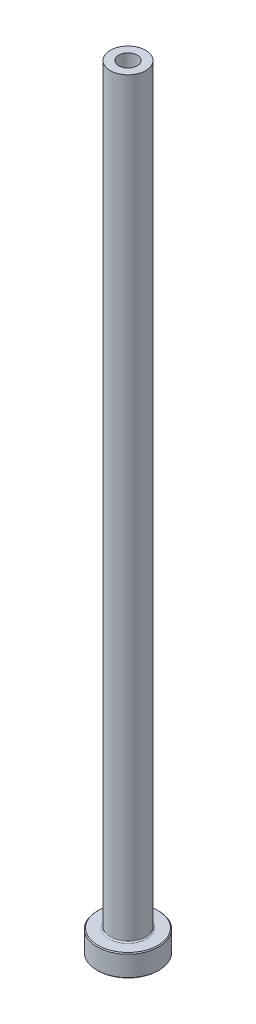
ISO-10303-21;
HEADER;
FILE_DESCRIPTION(('STEP AP214'),'2;1');
FILE_NAME('part.step','',(''),(''),'','','');
FILE_SCHEMA(('AUTOMOTIVE_DESIGN { 1 0 10303 214 1 1 1 1 }'));
ENDSEC;
DATA;
#1=APPLICATION_CONTEXT('core data for automotive mechanical design processes');
#2=APPLICATION_PROTOCOL_DEFINITION('international standard','automotive_design',2000,#1);
#3=PRODUCT_CONTEXT('',#1,'mechanical');
#4=PRODUCT('Part','Part','',(#3));
#5=PRODUCT_RELATED_PRODUCT_CATEGORY('part','',(#4));
#6=PRODUCT_DEFINITION_FORMATION('','',#4);
#7=PRODUCT_DEFINITION_CONTEXT('part definition',#1,'design');
#8=PRODUCT_DEFINITION('design','',#6,#7);
#9=PRODUCT_DEFINITION_SHAPE('','',#8);
#10=(LENGTH_UNIT() NAMED_UNIT(*) SI_UNIT(.MILLI.,.METRE.));
#11=(NAMED_UNIT(*) PLANE_ANGLE_UNIT() SI_UNIT($,.RADIAN.));
#12=(NAMED_UNIT(*) SI_UNIT($,.STERADIAN.) SOLID_ANGLE_UNIT());
#13=UNCERTAINTY_MEASURE_WITH_UNIT(LENGTH_MEASURE(1.E-05),#10,'distance_accuracy_value','');
#14=(GEOMETRIC_REPRESENTATION_CONTEXT(3) GLOBAL_UNCERTAINTY_ASSIGNED_CONTEXT((#13)) GLOBAL_UNIT_ASSIGNED_CONTEXT((#10,
#11,#12)) REPRESENTATION_CONTEXT('',''));
#15=CARTESIAN_POINT('',(0.,0.,0.));
#16=DIRECTION('',(0.,0.,1.));
#17=DIRECTION('',(1.,0.,0.));
#18=AXIS2_PLACEMENT_3D('',#15,#16,#17);
#19=CARTESIAN_POINT('',(0.,92.1876809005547,0.));
#20=DIRECTION('',(0.,1.,0.));
#21=DIRECTION('',(0.,0.,1.));
#22=AXIS2_PLACEMENT_3D('',#19,#20,#21);
#23=CYLINDRICAL_SURFACE('',#22,2.1);
#24=CARTESIAN_POINT('',(0.,175.,0.));
#25=DIRECTION('',(0.,1.,0.));
#26=DIRECTION('',(0.,0.,1.));
#27=AXIS2_PLACEMENT_3D('',#24,#25,#26);
#28=CIRCLE('',#27,2.1);
#29=CARTESIAN_POINT('',(0.,175.,2.1));
#30=VERTEX_POINT('',#29);
#31=EDGE_CURVE('E62',#30,#30,#28,.T.);
#32=ORIENTED_EDGE('',*,*,#31,.T.);
#33=EDGE_LOOP('',(#32));
#34=FACE_BOUND('',#33,.T.);
#35=CARTESIAN_POINT('',(0.,130.,0.));
#36=DIRECTION('',(0.,1.,0.));
#37=DIRECTION('',(0.,0.,1.));
#38=AXIS2_PLACEMENT_3D('',#35,#36,#37);
#39=CIRCLE('',#38,2.1);
#40=CARTESIAN_POINT('',(0.,130.,2.1));
#41=VERTEX_POINT('',#40);
#42=EDGE_CURVE('E71',#41,#41,#39,.T.);
#43=ORIENTED_EDGE('',*,*,#42,.F.);
#44=EDGE_LOOP('',(#43));
#45=FACE_BOUND('',#44,.T.);
#46=ADVANCED_FACE('F30',(#34,#45),#23,.F.);
#47=CARTESIAN_POINT('',(-2.1,175.,0.));
#48=DIRECTION('',(0.,1.,0.));
#49=DIRECTION('',(0.,0.,1.));
#50=AXIS2_PLACEMENT_3D('',#47,#48,#49);
#51=PLANE('',#50);
#52=CARTESIAN_POINT('',(0.,175.,0.));
#53=DIRECTION('',(0.,1.,0.));
#54=DIRECTION('',(0.,0.,1.));
#55=AXIS2_PLACEMENT_3D('',#52,#53,#54);
#56=CIRCLE('',#55,4.00000000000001);
#57=CARTESIAN_POINT('',(0.,175.,4.00000000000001));
#58=VERTEX_POINT('',#57);
#59=EDGE_CURVE('E65',#58,#58,#56,.T.);
#60=ORIENTED_EDGE('',*,*,#59,.T.);
#61=EDGE_LOOP('',(#60));
#62=FACE_BOUND('',#61,.T.);
#63=ORIENTED_EDGE('',*,*,#31,.F.);
#64=EDGE_LOOP('',(#63));
#65=FACE_BOUND('',#64,.T.);
#66=ADVANCED_FACE('F79',(#62,#65),#51,.T.);
#67=CARTESIAN_POINT('',(0.,92.1876809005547,0.));
#68=DIRECTION('',(0.,1.,0.));
#69=DIRECTION('',(0.,0.,1.));
#70=AXIS2_PLACEMENT_3D('',#67,#68,#69);
#71=CYLINDRICAL_SURFACE('',#70,4.);
#72=CARTESIAN_POINT('',(0.,5.3,0.));
#73=DIRECTION('',(0.,1.,0.));
#74=DIRECTION('',(0.,0.,1.));
#75=AXIS2_PLACEMENT_3D('',#72,#73,#74);
#76=CIRCLE('',#75,4.);
#77=CARTESIAN_POINT('',(0.,5.3,4.));
#78=VERTEX_POINT('',#77);
#79=EDGE_CURVE('E59',#78,#78,#76,.T.);
#80=ORIENTED_EDGE('',*,*,#79,.T.);
#81=EDGE_LOOP('',(#80));
#82=FACE_BOUND('',#81,.T.);
#83=ORIENTED_EDGE('',*,*,#59,.F.);
#84=EDGE_LOOP('',(#83));
#85=FACE_BOUND('',#84,.T.);
#86=ADVANCED_FACE('F85',(#82,#85),#71,.T.);
#87=CARTESIAN_POINT('',(-3.99999999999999,5.,0.));
#88=DIRECTION('',(0.,1.,0.));
#89=DIRECTION('',(0.,0.,1.));
#90=AXIS2_PLACEMENT_3D('',#87,#88,#89);
#91=PLANE('',#90);
#92=CARTESIAN_POINT('',(0.,5.,0.));
#93=DIRECTION('',(0.,1.,0.));
#94=DIRECTION('',(0.,0.,1.));
#95=AXIS2_PLACEMENT_3D('',#92,#93,#94);
#96=CIRCLE('',#95,6.79999999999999);
#97=CARTESIAN_POINT('',(0.,5.,6.79999999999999));
#98=VERTEX_POINT('',#97);
#99=EDGE_CURVE('E53',#98,#98,#96,.T.);
#100=ORIENTED_EDGE('',*,*,#99,.T.);
#101=EDGE_LOOP('',(#100));
#102=FACE_BOUND('',#101,.T.);
#103=CARTESIAN_POINT('',(0.,5.,0.));
#104=DIRECTION('',(0.,1.,0.));
#105=DIRECTION('',(0.,0.,1.));
#106=AXIS2_PLACEMENT_3D('',#103,#104,#105);
#107=CIRCLE('',#106,4.3);
#108=CARTESIAN_POINT('',(0.,5.,4.3));
#109=VERTEX_POINT('',#108);
#110=EDGE_CURVE('E56',#109,#109,#107,.F.);
#111=ORIENTED_EDGE('',*,*,#110,.T.);
#112=EDGE_LOOP('',(#111));
#113=FACE_BOUND('',#112,.T.);
#114=ADVANCED_FACE('F111',(#102,#113),#91,.T.);
#115=CARTESIAN_POINT('',(0.,92.1876809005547,0.));
#116=DIRECTION('',(0.,1.,0.));
#117=DIRECTION('',(0.,0.,1.));
#118=AXIS2_PLACEMENT_3D('',#115,#116,#117);
#119=CYLINDRICAL_SURFACE('',#118,6.99999999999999);
#120=CARTESIAN_POINT('',(0.,4.79999999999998,0.));
#121=DIRECTION('',(0.,1.,0.));
#122=DIRECTION('',(0.,0.,1.));
#123=AXIS2_PLACEMENT_3D('',#120,#121,#122);
#124=CIRCLE('',#123,6.99999999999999);
#125=CARTESIAN_POINT('',(0.,4.79999999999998,6.99999999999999));
#126=VERTEX_POINT('',#125);
#127=EDGE_CURVE('E45',#126,#126,#124,.F.);
#128=ORIENTED_EDGE('',*,*,#127,.T.);
#129=EDGE_LOOP('',(#128));
#130=FACE_BOUND('',#129,.T.);
#131=CARTESIAN_POINT('',(0.,0.20000000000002,0.));
#132=DIRECTION('',(0.,-1.,0.));
#133=DIRECTION('',(0.,0.,-1.));
#134=AXIS2_PLACEMENT_3D('',#131,#132,#133);
#135=CIRCLE('',#134,6.99999999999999);
#136=CARTESIAN_POINT('',(0.,0.20000000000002,-6.99999999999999));
#137=VERTEX_POINT('',#136);
#138=EDGE_CURVE('E50',#137,#137,#135,.F.);
#139=ORIENTED_EDGE('',*,*,#138,.T.);
#140=EDGE_LOOP('',(#139));
#141=FACE_BOUND('',#140,.T.);
#142=ADVANCED_FACE('F108',(#130,#141),#119,.T.);
#143=CARTESIAN_POINT('',(-6.99999999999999,0.,0.));
#144=DIRECTION('',(0.,-1.,0.));
#145=DIRECTION('',(0.,0.,-1.));
#146=AXIS2_PLACEMENT_3D('',#143,#144,#145);
#147=PLANE('',#146);
#148=CARTESIAN_POINT('',(0.,0.,0.));
#149=DIRECTION('',(0.,-1.,0.));
#150=DIRECTION('',(0.,0.,-1.));
#151=AXIS2_PLACEMENT_3D('',#148,#149,#150);
#152=CIRCLE('',#151,2.84999999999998);
#153=CARTESIAN_POINT('',(0.,0.,-2.84999999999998));
#154=VERTEX_POINT('',#153);
#155=EDGE_CURVE('E37',#154,#154,#152,.F.);
#156=ORIENTED_EDGE('',*,*,#155,.T.);
#157=EDGE_LOOP('',(#156));
#158=FACE_BOUND('',#157,.T.);
#159=CARTESIAN_POINT('',(0.,0.,0.));
#160=DIRECTION('',(0.,-1.,0.));
#161=DIRECTION('',(0.,0.,-1.));
#162=AXIS2_PLACEMENT_3D('',#159,#160,#161);
#163=CIRCLE('',#162,6.79999999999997);
#164=CARTESIAN_POINT('',(0.,0.,-6.79999999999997));
#165=VERTEX_POINT('',#164);
#166=EDGE_CURVE('E41',#165,#165,#163,.T.);
#167=ORIENTED_EDGE('',*,*,#166,.T.);
#168=EDGE_LOOP('',(#167));
#169=FACE_BOUND('',#168,.T.);
#170=ADVANCED_FACE('F110',(#158,#169),#147,.T.);
#171=CARTESIAN_POINT('',(0.,92.1876809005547,0.));
#172=DIRECTION('',(0.,1.,0.));
#173=DIRECTION('',(0.,0.,1.));
#174=AXIS2_PLACEMENT_3D('',#171,#172,#173);
#175=CYLINDRICAL_SURFACE('',#174,2.35);
#176=CARTESIAN_POINT('',(0.,0.499999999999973,0.));
#177=DIRECTION('',(0.,-1.,0.));
#178=DIRECTION('',(0.,0.,-1.));
#179=AXIS2_PLACEMENT_3D('',#176,#177,#178);
#180=CIRCLE('',#179,2.35);
#181=CARTESIAN_POINT('',(0.,0.499999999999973,-2.35));
#182=VERTEX_POINT('',#181);
#183=EDGE_CURVE('E10',#182,#182,#180,.T.);
#184=ORIENTED_EDGE('',*,*,#183,.T.);
#185=EDGE_LOOP('',(#184));
#186=FACE_BOUND('',#185,.T.);
#187=CARTESIAN_POINT('',(0.,118.,0.));
#188=DIRECTION('',(0.,1.,0.));
#189=DIRECTION('',(0.,0.,1.));
#190=AXIS2_PLACEMENT_3D('',#187,#188,#189);
#191=CIRCLE('',#190,2.35000000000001);
#192=CARTESIAN_POINT('',(0.,118.,2.35000000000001));
#193=VERTEX_POINT('',#192);
#194=EDGE_CURVE('E68',#193,#193,#191,.T.);
#195=ORIENTED_EDGE('',*,*,#194,.T.);
#196=EDGE_LOOP('',(#195));
#197=FACE_BOUND('',#196,.T.);
#198=ADVANCED_FACE('F118',(#186,#197),#175,.F.);
#199=CARTESIAN_POINT('',(0.,118.,0.));
#200=DIRECTION('',(0.,-1.,0.));
#201=DIRECTION('',(0.,0.,-1.));
#202=AXIS2_PLACEMENT_3D('',#199,#200,#201);
#203=CONICAL_SURFACE('',#202,2.35000000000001,0.0208303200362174);
#204=ORIENTED_EDGE('',*,*,#42,.T.);
#205=EDGE_LOOP('',(#204));
#206=FACE_BOUND('',#205,.T.);
#207=ORIENTED_EDGE('',*,*,#194,.F.);
#208=EDGE_LOOP('',(#207));
#209=FACE_BOUND('',#208,.T.);
#210=ADVANCED_FACE('F75',(#206,#209),#203,.F.);
#211=CARTESIAN_POINT('',(0.,5.3,0.));
#212=DIRECTION('',(0.,1.,0.));
#213=DIRECTION('',(0.,0.,1.));
#214=AXIS2_PLACEMENT_3D('',#211,#212,#213);
#215=TOROIDAL_SURFACE('',#214,4.3,0.3);
#216=ORIENTED_EDGE('',*,*,#110,.F.);
#217=EDGE_LOOP('',(#216));
#218=FACE_BOUND('',#217,.T.);
#219=ORIENTED_EDGE('',*,*,#79,.F.);
#220=EDGE_LOOP('',(#219));
#221=FACE_BOUND('',#220,.T.);
#222=ADVANCED_FACE('F90',(#218,#221),#215,.F.);
#223=CARTESIAN_POINT('',(0.,5.,0.));
#224=DIRECTION('',(0.,-1.,0.));
#225=DIRECTION('',(0.,0.,-1.));
#226=AXIS2_PLACEMENT_3D('',#223,#224,#225);
#227=CONICAL_SURFACE('',#226,6.79999999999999,0.785398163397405);
#228=ORIENTED_EDGE('',*,*,#127,.F.);
#229=EDGE_LOOP('',(#228));
#230=FACE_BOUND('',#229,.T.);
#231=ORIENTED_EDGE('',*,*,#99,.F.);
#232=EDGE_LOOP('',(#231));
#233=FACE_BOUND('',#232,.T.);
#234=ADVANCED_FACE('F93',(#230,#233),#227,.T.);
#235=CARTESIAN_POINT('',(0.,0.20000000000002,0.));
#236=DIRECTION('',(0.,1.,0.));
#237=DIRECTION('',(0.,0.,1.));
#238=AXIS2_PLACEMENT_3D('',#235,#236,#237);
#239=CONICAL_SURFACE('',#238,6.99999999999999,0.78539816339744);
#240=ORIENTED_EDGE('',*,*,#166,.F.);
#241=EDGE_LOOP('',(#240));
#242=FACE_BOUND('',#241,.T.);
#243=ORIENTED_EDGE('',*,*,#138,.F.);
#244=EDGE_LOOP('',(#243));
#245=FACE_BOUND('',#244,.T.);
#246=ADVANCED_FACE('F96',(#242,#245),#239,.T.);
#247=CARTESIAN_POINT('',(0.,0.,0.));
#248=DIRECTION('',(0.,-1.,0.));
#249=DIRECTION('',(0.,0.,-1.));
#250=AXIS2_PLACEMENT_3D('',#247,#248,#249);
#251=CONICAL_SURFACE('',#250,2.84999999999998,0.785398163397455);
#252=ORIENTED_EDGE('',*,*,#183,.F.);
#253=EDGE_LOOP('',(#252));
#254=FACE_BOUND('',#253,.T.);
#255=ORIENTED_EDGE('',*,*,#155,.F.);
#256=EDGE_LOOP('',(#255));
#257=FACE_BOUND('',#256,.T.);
#258=ADVANCED_FACE('F32',(#254,#257),#251,.F.);
#259=CLOSED_SHELL('',(#46,#66,#86,#114,#142,#170,#198,#210,#222,#234,#246,#258));
#260=MANIFOLD_SOLID_BREP('B2',#259);
#261=ADVANCED_BREP_SHAPE_REPRESENTATION('',(#18,#260),#14);
#262=SHAPE_DEFINITION_REPRESENTATION(#9,#261);
ENDSEC;
END-ISO-10303-21;
